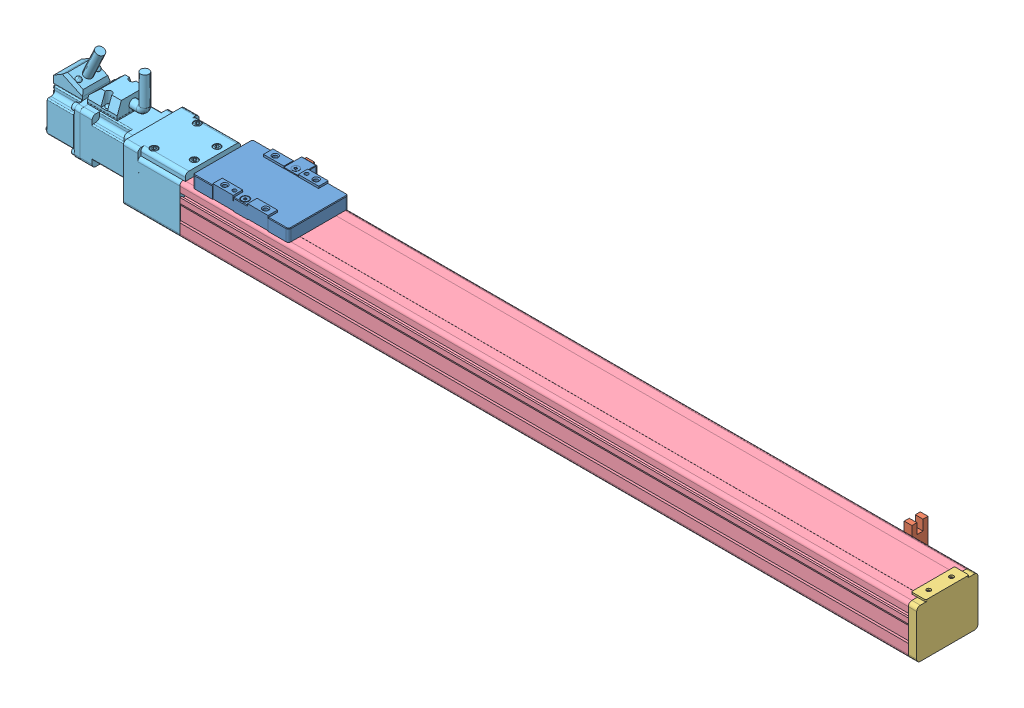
SolidWorks assembly TCD50-P-Z-0.SLDASM, configuration 500 (file format 9000). Lengths in mm.
Overall size (732.03 80 64.4).
6 component instances, 5 part files, 16 mates.
Components (placement in the parent):
- TCD50-P-Z-2-1: TCD50-P-Z-2.sldprt [默认] at (-255.0977 0 0)
- TCD50-P-Z-3-1: TCD50-P-Z-3.sldprt [默认] at (104.9 0 0)
- TCD50-P-Z-4-1: TCD50-P-Z-4.sldprt [默认] at (100 0 0)
- TCD50-P-Z-5-1: TCD50-P-Z-5.SLDPRT [500] at (-578.3345 -1.5 0) x (0 0 -1) z (1 0 0) size (51 42.1 606)
- TCD50-P-Z-3-2: TCD50-P-Z-3.sldprt [默认] at (-405.7 0 0)
- TCD50-P-Z-1-1: TCD50-P-Z-1.sldprt [默认] at (50 0 0)
Mates (geometry in assembly coordinates):
- 重合10: coincident anti-aligned: plane of TCD50-P-Z-4-1 through (27.6655 19.5 0) normal (-1 0 0); plane of TCD50-P-Z-5-1 through (27.6655 37.5 -22.5) normal (1 0 0)
- 重合11: coincident aligned: plane of TCD50-P-Z-4-1 through (31.1655 20.25 25.5) normal (0 0 1); plane of TCD50-P-Z-5-1 through (27.6655 29.3 25.5) normal (0 0 1)
- 重合12: coincident aligned: plane of TCD50-P-Z-4-1 through (31.1655 40.5 19.75) normal (0 1 0); plane of TCD50-P-Z-5-1 through (27.6655 40.5 15) normal (0 1 0)
- 距离3: distance = 0.5 mm aligned: plane of TCD50-P-Z-2-1 through (-528.4322 46.75 25) normal (0 0 1); plane of TCD50-P-Z-5-1 through (27.6655 29.3 25.5) normal (0 0 1)
- 距离4: distance = 54 mm anti-aligned: plane of TCD50-P-Z-5-1 through (27.6655 -1.5 11.5) normal (0 -1 0); plane of TCD50-P-Z-2-1 through (-542.9322 52.5 21.075) normal (0 1 0)
- 距离5: distance = 6.4 mm aligned: plane of TCD50-P-Z-5-1 through (27.6655 40.5 -22.5) normal (0 1 0); plane of TCD50-P-Z-3-1 through (-15.4345 34.1 -27) normal (0 1 0)
- 重合13: coincident anti-aligned: plane of TCD50-P-Z-3-1 through (-23.5345 33.3 -25.5) normal (0 0 1); plane of TCD50-P-Z-5-1 through (27.6655 32.7 -25.5) normal (0 0 -1)
- LimitDistance1: limit distance = 523.0977 mm aligned: plane of TCD50-P-Z-2-1 through (-488.4322 45.75 0) normal (1 0 0); plane of TCD50-P-Z-4-1 through (34.6655 21 0) normal (1 0 0)
- LimitDistance2: limit distance = 56.9023 mm aligned: plane of TCD50-P-Z-1-1 through (-625.3345 23.25 0) normal (-1 0 0); plane of TCD50-P-Z-2-1 through (-568.4322 45.75 0) normal (-1 0 0)
- 重合16: coincident aligned: plane of TCD50-P-Z-3-1 through (-15.4345 31 -28.5) normal (0 0 -1); plane of TCD50-P-Z-3-2 through (-526.0345 31 -28.5) normal (0 0 -1)
- 重合17: coincident aligned: plane of TCD50-P-Z-3-1 through (-15.4345 34.1 -27) normal (0 1 0); plane of TCD50-P-Z-3-2 through (-526.0345 34.1 -27) normal (0 1 0)
- 重合18: coincident aligned: plane of TCD50-P-Z-5-1 through (27.6655 -1.5 11.5) normal (0 -1 0); plane of TCD50-P-Z-1-1 through (-582.8345 -1.5 0) normal (0 -1 0)
- 重合19: coincident aligned: plane of TCD50-P-Z-5-1 through (27.6655 3 -25.5) normal (0 0 -1); plane of TCD50-P-Z-1-1 through (-601.8345 23.25 -25.5) normal (0 0 -1)
- 重合20: coincident anti-aligned: plane of TCD50-P-Z-5-1 through (-578.3345 37.5 -22.5) normal (-1 0 0); plane of TCD50-P-Z-1-1 through (-578.3345 19.5 0) normal (1 0 0)
- 距离6: distance = 55 mm aligned: plane of TCD50-P-Z-3-1 through (-20.3345 33.3 -32.2) normal (1 0 0); plane of TCD50-P-Z-4-1 through (34.6655 21 0) normal (1 0 0)
- 距离7: distance = 88 mm aligned: plane of TCD50-P-Z-1-1 through (-625.3345 23.25 0) normal (-1 0 0); plane of TCD50-P-Z-3-2 through (-537.3345 33.3 -32.2) normal (-1 0 0)
